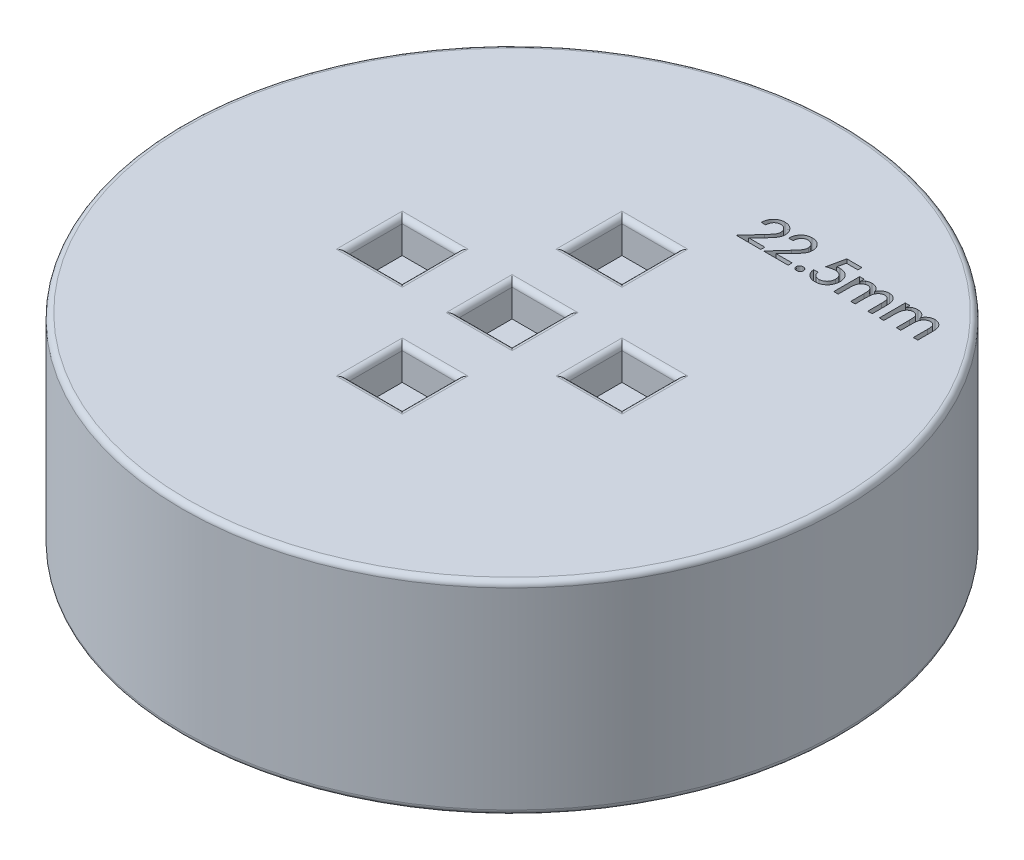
from build123d import *

# Parameters (mm, degrees)
SKETCH1_R           = 30
BOSS_EXTRUDE1_DEPTH = 18.5
SKETCH2_W           = 5
SKETCH2_H           = 5
CUT_EXTRUDE1_DEPTH  = 3
FILLET1_R           = 0.5
SKETCH4_W           = 5
SKETCH4_H           = 5
CUT_EXTRUDE2_DEPTH  = 3
FILLET2_R           = 0.5
FILLET3_R           = 0.5
CUT_EXTRUDE3_DEPTH  = 2


with BuildPart() as part:
    # Sketch1 → Boss-Extrude1 (new body)
    with BuildSketch(Plane(origin=(0, 0, 0), x_dir=(1, 0, 0), z_dir=(0, 1, 0))):
        with Locations(Location((0, 0, 0), (0, 0, 270))):
            Circle(SKETCH1_R)
    extrude(amount=BOSS_EXTRUDE1_DEPTH)

    # Sketch2 → Cut-Extrude1 (cut)
    with BuildSketch(Plane(origin=(0, 18.5, 0), x_dir=(1, 0, 0), z_dir=(0, 1, 0))):
        with Locations((0, -10)):
            Rectangle(SKETCH2_W, SKETCH2_H)
        with Locations((-10, 0)):
            Rectangle(SKETCH2_W, SKETCH2_H)
        Rectangle(SKETCH2_W, SKETCH2_H)
        with Locations((0, 10)):
            Rectangle(SKETCH2_W, SKETCH2_H)
        with Locations((10, 0)):
            Rectangle(SKETCH2_W, SKETCH2_H)
    extrude(amount=-CUT_EXTRUDE1_DEPTH, mode=Mode.SUBTRACT)

    # Fillet1
    fillet1_edges = [part.edges().sort_by_distance(p)[0] for p in [
        (2.5, 18.5, 0),
        (0, 18.5, 2.5),
        (-12.5, 18.5, 0),
        (-10, 18.5, 2.5),
        (-7.5, 18.5, 0),
        (-10, 18.5, -2.5),
    ]]
    fillet(fillet1_edges, radius=FILLET1_R)

    # Sketch4 → Cut-Extrude2 (cut)
    with BuildSketch(Plane(origin=(0, 0, 0), x_dir=(-1, 0, 0), z_dir=(0, -1, 0))):
        Rectangle(SKETCH4_W, SKETCH4_H)
        with Locations((0, -10)):
            Rectangle(SKETCH4_W, SKETCH4_H)
        with Locations((10, 0)):
            Rectangle(SKETCH4_W, SKETCH4_H)
        with Locations((-10, 0)):
            Rectangle(SKETCH4_W, SKETCH4_H)
        with Locations((0, 10)):
            Rectangle(SKETCH4_W, SKETCH4_H)
    extrude(amount=-CUT_EXTRUDE2_DEPTH, mode=Mode.SUBTRACT)

    # Fillet2
    fillet2_edges = [part.edges().sort_by_distance(p)[0] for p in [
        (-2.5, 0, 0),
        (0, 0, -2.5),
        (2.5, 0, 0),
        (0, 0, 2.5),
        (-2.5, 0, 10),
        (0, 0, 7.5),
        (2.5, 0, 10),
        (0, 0, 12.5),
        (-12.5, 0, 0),
        (-10, 0, -2.5),
        (-7.5, 0, 0),
        (-10, 0, 2.5),
        (7.5, 0, 0),
        (10, 0, -2.5),
        (12.5, 0, 0),
        (10, 0, 2.5),
        (2.5, 0, -10),
        (0, 0, -7.5),
        (-2.5, 0, -10),
        (0, 0, -12.5),
        (0, 0, -30),
    ]]
    fillet(fillet2_edges, radius=FILLET2_R)

    # Fillet3
    fillet3_edges = [part.edges().sort_by_distance(p)[0] for p in [
        (0, 18.5, -30),
        (0, 18.5, 7.5),
        (-2.5, 18.5, 10),
        (0, 18.5, 12.5),
        (2.5, 18.5, 10),
        (-2.5, 18.5, 0.25),
        (0.25, 18.5, -2.5),
        (0, 18.5, -12.5),
        (-2.5, 18.5, -10),
        (0, 18.5, -7.5),
        (2.5, 18.5, -10),
        (10, 18.5, 2.5),
        (12.5, 18.5, 0),
        (10, 18.5, -2.5),
        (7.5, 18.5, 0),
    ]]
    fillet(fillet3_edges, radius=FILLET3_R)

    # Sketch5 → Cut-Extrude3 (cut)
    with BuildSketch(Plane(origin=(0, 18.5, 0), x_dir=(1, 0, 0), z_dir=(0, 1, 0))):
        with BuildLine():
            Line((4.630208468, 18.456706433), (4.227609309, 18.456706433))
            add(Edge.make_bspline(
                [(4.227609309, 18.456706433), (4.229500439, 18.497673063), (4.233199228, 18.577798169), (4.249623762, 18.694549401), (4.276230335, 18.804558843), (4.309813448, 18.908759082), (4.354612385, 19.00584756), (4.406301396, 19.097516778), (4.468701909, 19.181845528), (4.539217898, 19.258967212), (4.615765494, 19.329035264), (4.698054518, 19.389453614), (4.784694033, 19.440938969), (4.875701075, 19.482951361), (4.971253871, 19.515480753), (5.071080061, 19.539151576), (5.175498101, 19.553389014), (5.246677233, 19.554952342), (5.282762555, 19.555744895)],
                knots=[0, 0, 0, 0, 1.154964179, 2.258951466, 3.315045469, 4.34063582, 5.337653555, 6.322213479, 7.300594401, 8.285733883, 9.262436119, 10.219305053, 11.156568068, 12.097250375, 13.037875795, 13.995471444, 14.983774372, 16, 16, 16, 16], degree=3))
            add(Edge.make_bspline(
                [(5.282762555, 19.555744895), (5.320543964, 19.554972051), (5.394681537, 19.553455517), (5.5026437, 19.539184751), (5.604820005, 19.51617315), (5.701240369, 19.484747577), (5.79172912, 19.442786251), (5.876464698, 19.39218552), (5.954632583, 19.331365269), (6.026800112, 19.263311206), (6.0905427, 19.188451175), (6.14811535, 19.111486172), (6.195704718, 19.030855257), (6.235572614, 18.948030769), (6.266251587, 18.862332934), (6.287916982, 18.774110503), (6.300903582, 18.683303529), (6.302676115, 18.6219008), (6.303570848, 18.590906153)],
                knots=[0, 0, 0, 0, 1.156722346, 2.269809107, 3.328396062, 4.361258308, 5.3694338, 6.377253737, 7.377324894, 8.397019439, 9.4098266, 10.385180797, 11.337325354, 12.27255833, 13.196816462, 14.119704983, 15.050871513, 16, 16, 16, 16], degree=3))
            add(Edge.make_bspline(
                [(6.303570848, 18.590906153), (6.301942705, 18.547549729), (6.298708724, 18.461430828), (6.273806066, 18.334022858), (6.231941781, 18.210718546), (6.183584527, 18.110316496), (6.134676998, 18.029160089), (6.089794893, 17.962172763), (6.037070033, 17.889739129), (5.975371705, 17.812344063), (5.907153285, 17.728216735), (5.829704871, 17.639527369), (5.745423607, 17.544480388), (5.685315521, 17.480480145), (5.654196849, 17.447346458)],
                knots=[0, 0, 0, 0, 1.155755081, 2.295677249, 3.447123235, 4.6205014, 5.259503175, 5.973005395, 6.77029923, 7.648035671, 8.612336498, 9.658570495, 10.787814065, 12, 12, 12, 12], degree=3))
            Line((5.654196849, 17.447346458), (4.873167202, 16.665680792))
            Line((4.873167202, 16.665680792), (6.344275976, 16.665680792))
            Line((6.344275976, 16.665680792), (6.344275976, 16.299334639))
            Line((6.344275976, 16.299334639), (4.105493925, 16.299334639))
            Line((4.105493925, 16.299334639), (5.320287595, 17.640695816))
            add(Edge.make_bspline(
                [(5.320287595, 17.640695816), (5.349222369, 17.67155443), (5.404748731, 17.730772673), (5.483005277, 17.817458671), (5.553610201, 17.897598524), (5.616939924, 17.971134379), (5.671336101, 18.039054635), (5.718262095, 18.100360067), (5.757186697, 18.155340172), (5.797610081, 18.220056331), (5.837665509, 18.297633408), (5.871739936, 18.392266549), (5.892186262, 18.488907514), (5.895074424, 18.553922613), (5.896519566, 18.58645403)],
                knots=[0, 0, 0, 0, 1.341560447, 2.574479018, 3.703506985, 4.728875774, 5.651874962, 6.462761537, 7.177175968, 7.787249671, 8.88179658, 9.938774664, 10.968630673, 12, 12, 12, 12], degree=3))
            add(Edge.make_bspline(
                [(5.896519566, 18.58645403), (5.896163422, 18.606635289), (5.89545872, 18.646567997), (5.885851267, 18.705044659), (5.872317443, 18.761763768), (5.851385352, 18.81581345), (5.826166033, 18.868257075), (5.794621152, 18.918416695), (5.756741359, 18.965827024), (5.714603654, 19.011554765), (5.667998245, 19.052841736), (5.618771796, 19.08987011), (5.566318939, 19.119941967), (5.512073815, 19.146240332), (5.454350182, 19.164884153), (5.394566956, 19.178765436), (5.332254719, 19.18838128), (5.289795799, 19.189055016), (5.268134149, 19.189398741)],
                knots=[0, 0, 0, 0, 0.999432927, 1.977580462, 2.931018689, 3.885672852, 4.844657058, 5.812871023, 6.815890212, 7.849665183, 8.891901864, 9.898878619, 10.897592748, 11.885014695, 12.882178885, 13.896915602, 14.927050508, 16, 16, 16, 16], degree=3))
            add(Edge.make_bspline(
                [(5.268134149, 19.189398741), (5.247540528, 19.188976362), (5.207027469, 19.188145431), (5.147361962, 19.179572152), (5.090090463, 19.165613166), (5.035019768, 19.146250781), (4.981751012, 19.122363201), (4.931586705, 19.091416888), (4.883706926, 19.055416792), (4.837478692, 19.015012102), (4.795405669, 18.967609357), (4.757774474, 18.91377029), (4.724544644, 18.853436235), (4.696141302, 18.786712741), (4.672602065, 18.713424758), (4.653718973, 18.6336614), (4.639120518, 18.547387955), (4.633234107, 18.487492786), (4.630208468, 18.456706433)],
                knots=[0, 0, 0, 0, 0.911540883, 1.79324023, 2.663162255, 3.518366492, 4.375475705, 5.243419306, 6.122264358, 7.02676621, 7.957780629, 8.921596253, 9.930241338, 11.002848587, 12.128200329, 13.335197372, 14.630280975, 16, 16, 16, 16], degree=3))
        make_face()
        with BuildLine():
            Line((7.113221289, 18.456706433), (6.71062213, 18.456706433))
            add(Edge.make_bspline(
                [(6.71062213, 18.456706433), (6.712513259, 18.497673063), (6.716212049, 18.577798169), (6.732636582, 18.694549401), (6.759243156, 18.804558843), (6.792826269, 18.908759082), (6.837625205, 19.00584756), (6.889314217, 19.097516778), (6.95171473, 19.181845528), (7.022230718, 19.258967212), (7.098778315, 19.329035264), (7.181067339, 19.389453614), (7.267706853, 19.440938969), (7.358713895, 19.482951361), (7.454266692, 19.515480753), (7.554092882, 19.539151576), (7.658510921, 19.553389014), (7.729690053, 19.554952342), (7.765775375, 19.555744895)],
                knots=[0, 0, 0, 0, 1.154964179, 2.258951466, 3.315045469, 4.34063582, 5.337653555, 6.322213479, 7.300594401, 8.285733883, 9.262436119, 10.219305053, 11.156568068, 12.097250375, 13.037875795, 13.995471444, 14.983774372, 16, 16, 16, 16], degree=3))
            add(Edge.make_bspline(
                [(7.765775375, 19.555744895), (7.803556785, 19.554972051), (7.877694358, 19.553455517), (7.985656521, 19.539184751), (8.087832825, 19.51617315), (8.184253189, 19.484747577), (8.274741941, 19.442786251), (8.359477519, 19.39218552), (8.437645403, 19.331365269), (8.509812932, 19.263311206), (8.573555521, 19.188451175), (8.63112817, 19.111486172), (8.678717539, 19.030855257), (8.718585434, 18.948030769), (8.749264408, 18.862332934), (8.770929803, 18.774110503), (8.783916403, 18.683303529), (8.785688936, 18.6219008), (8.786583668, 18.590906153)],
                knots=[0, 0, 0, 0, 1.156722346, 2.269809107, 3.328396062, 4.361258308, 5.3694338, 6.377253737, 7.377324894, 8.397019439, 9.4098266, 10.385180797, 11.337325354, 12.27255833, 13.196816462, 14.119704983, 15.050871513, 16, 16, 16, 16], degree=3))
            add(Edge.make_bspline(
                [(8.786583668, 18.590906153), (8.784955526, 18.547549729), (8.781721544, 18.461430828), (8.756818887, 18.334022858), (8.714954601, 18.210718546), (8.666597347, 18.110316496), (8.617689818, 18.029160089), (8.572807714, 17.962172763), (8.520082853, 17.889739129), (8.458384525, 17.812344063), (8.390166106, 17.728216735), (8.312717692, 17.639527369), (8.228436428, 17.544480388), (8.168328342, 17.480480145), (8.13720967, 17.447346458)],
                knots=[0, 0, 0, 0, 1.155755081, 2.295677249, 3.447123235, 4.6205014, 5.259503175, 5.973005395, 6.77029923, 7.648035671, 8.612336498, 9.658570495, 10.787814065, 12, 12, 12, 12], degree=3))
            Line((8.13720967, 17.447346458), (7.356180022, 16.665680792))
            Line((7.356180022, 16.665680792), (8.827288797, 16.665680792))
            Line((8.827288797, 16.665680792), (8.827288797, 16.299334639))
            Line((8.827288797, 16.299334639), (6.588506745, 16.299334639))
            Line((6.588506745, 16.299334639), (7.803300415, 17.640695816))
            add(Edge.make_bspline(
                [(7.803300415, 17.640695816), (7.83223519, 17.67155443), (7.887761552, 17.730772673), (7.966018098, 17.817458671), (8.036623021, 17.897598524), (8.099952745, 17.971134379), (8.154348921, 18.039054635), (8.201274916, 18.100360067), (8.240199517, 18.155340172), (8.280622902, 18.220056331), (8.320678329, 18.297633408), (8.354752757, 18.392266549), (8.375199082, 18.488907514), (8.378087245, 18.553922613), (8.379532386, 18.58645403)],
                knots=[0, 0, 0, 0, 1.341560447, 2.574479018, 3.703506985, 4.728875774, 5.651874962, 6.462761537, 7.177175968, 7.787249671, 8.88179658, 9.938774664, 10.968630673, 12, 12, 12, 12], degree=3))
            add(Edge.make_bspline(
                [(8.379532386, 18.58645403), (8.379176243, 18.606635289), (8.378471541, 18.646567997), (8.368864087, 18.705044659), (8.355330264, 18.761763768), (8.334398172, 18.81581345), (8.309178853, 18.868257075), (8.277633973, 18.918416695), (8.23975418, 18.965827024), (8.197616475, 19.011554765), (8.151011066, 19.052841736), (8.101784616, 19.08987011), (8.049331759, 19.119941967), (7.995086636, 19.146240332), (7.937363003, 19.164884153), (7.877579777, 19.178765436), (7.815267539, 19.18838128), (7.772808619, 19.189055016), (7.75114697, 19.189398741)],
                knots=[0, 0, 0, 0, 0.999432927, 1.977580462, 2.931018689, 3.885672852, 4.844657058, 5.812871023, 6.815890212, 7.849665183, 8.891901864, 9.898878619, 10.897592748, 11.885014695, 12.882178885, 13.896915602, 14.927050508, 16, 16, 16, 16], degree=3))
            add(Edge.make_bspline(
                [(7.75114697, 19.189398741), (7.730553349, 19.188976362), (7.69004029, 19.188145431), (7.630374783, 19.179572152), (7.573103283, 19.165613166), (7.518032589, 19.146250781), (7.464763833, 19.122363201), (7.414599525, 19.091416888), (7.366719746, 19.055416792), (7.320491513, 19.015012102), (7.278418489, 18.967609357), (7.240787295, 18.91377029), (7.207557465, 18.853436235), (7.179154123, 18.786712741), (7.155614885, 18.713424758), (7.136731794, 18.6336614), (7.122133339, 18.547387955), (7.116246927, 18.487492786), (7.113221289, 18.456706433)],
                knots=[0, 0, 0, 0, 0.911540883, 1.79324023, 2.663162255, 3.518366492, 4.375475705, 5.243419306, 6.122264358, 7.02676621, 7.957780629, 8.921596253, 9.930241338, 11.002848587, 12.128200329, 13.335197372, 14.630280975, 16, 16, 16, 16], degree=3))
        make_face()
        with BuildLine():
            add(Edge.make_bspline(
                [(9.621038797, 16.869206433), (9.645751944, 16.868260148), (9.69334192, 16.866437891), (9.760917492, 16.848142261), (9.821098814, 16.817751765), (9.871537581, 16.775525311), (9.91382962, 16.727897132), (9.943859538, 16.675626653), (9.964193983, 16.620926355), (9.966084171, 16.582962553), (9.967032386, 16.563917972)],
                knots=[0, 0, 0, 0, 1.15701891, 2.228065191, 3.255424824, 4.294461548, 5.295444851, 6.226722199, 7.110433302, 8, 8, 8, 8], degree=3))
            add(Edge.make_bspline(
                [(9.967032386, 16.563917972), (9.965998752, 16.545111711), (9.963930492, 16.507481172), (9.944707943, 16.452691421), (9.914212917, 16.400539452), (9.872402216, 16.352370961), (9.821882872, 16.309938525), (9.761095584, 16.280528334), (9.693666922, 16.261215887), (9.645773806, 16.259510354), (9.621038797, 16.25862951)],
                knots=[0, 0, 0, 0, 0.879435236, 1.759712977, 2.690738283, 3.698978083, 4.737733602, 5.760330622, 6.843294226, 8, 8, 8, 8], degree=3))
            add(Edge.make_bspline(
                [(9.621038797, 16.25862951), (9.60057684, 16.259738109), (9.560438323, 16.261912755), (9.502616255, 16.278873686), (9.450157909, 16.307784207), (9.403421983, 16.346286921), (9.364684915, 16.393137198), (9.336300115, 16.445839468), (9.318919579, 16.503485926), (9.316824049, 16.543444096), (9.315750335, 16.563917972)],
                knots=[0, 0, 0, 0, 1.022542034, 2.005835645, 2.98339371, 4.000421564, 5.017449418, 6.004339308, 6.977457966, 8, 8, 8, 8], degree=3))
            add(Edge.make_bspline(
                [(9.315750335, 16.563917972), (9.316838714, 16.584596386), (9.318963, 16.624956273), (9.336026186, 16.682951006), (9.364708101, 16.735387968), (9.403642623, 16.781550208), (9.450229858, 16.820295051), (9.502967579, 16.848650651), (9.560604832, 16.86603877), (9.600564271, 16.868133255), (9.621038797, 16.869206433)],
                knots=[0, 0, 0, 0, 1.03279153, 2.015790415, 2.993055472, 4.001620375, 5.018343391, 6.004937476, 6.977764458, 8, 8, 8, 8], degree=3))
        make_face()
        with BuildLine():
            Line((12.36863495, 19.474334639), (12.36863495, 19.107988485))
            Line((12.36863495, 19.107988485), (11.32556604, 19.107988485))
            Line((11.32556604, 19.107988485), (11.155113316, 18.355579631))
            add(Edge.make_bspline(
                [(11.155113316, 18.355579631), (11.174998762, 18.365163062), (11.215923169, 18.384885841), (11.28434256, 18.40207039), (11.358626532, 18.414161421), (11.410522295, 18.415371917), (11.437505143, 18.416001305)],
                knots=[0, 0, 0, 0, 0.906577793, 1.865744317, 2.890308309, 4, 4, 4, 4], degree=3))
            add(Edge.make_bspline(
                [(11.437505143, 18.416001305), (11.475721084, 18.415301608), (11.550751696, 18.41392787), (11.660102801, 18.398576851), (11.764304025, 18.375578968), (11.862498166, 18.341270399), (11.955806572, 18.299034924), (12.043216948, 18.246183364), (12.12463851, 18.183612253), (12.199962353, 18.112387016), (12.268613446, 18.034805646), (12.327575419, 17.951025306), (12.378685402, 17.863493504), (12.419197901, 17.770697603), (12.451206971, 17.67359748), (12.473971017, 17.571787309), (12.488442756, 17.465572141), (12.48997412, 17.393120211), (12.490750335, 17.356395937)],
                knots=[0, 0, 0, 0, 1.094894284, 2.149641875, 3.159658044, 4.149576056, 5.125966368, 6.091225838, 7.071072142, 8.064343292, 9.05924964, 10.03573454, 10.996966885, 11.96032995, 12.932910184, 13.923798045, 14.947619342, 16, 16, 16, 16], degree=3))
            add(Edge.make_bspline(
                [(12.490750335, 17.356395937), (12.490153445, 17.330733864), (12.488972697, 17.279969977), (12.482819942, 17.204487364), (12.471075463, 17.13063295), (12.455481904, 17.057836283), (12.433995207, 16.986721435), (12.409535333, 16.916342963), (12.379484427, 16.847822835), (12.345176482, 16.781189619), (12.307112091, 16.716930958), (12.265201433, 16.655826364), (12.21934875, 16.59836436), (12.169391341, 16.545025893), (12.116694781, 16.494439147), (12.05988444, 16.447924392), (11.999121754, 16.405286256), (11.93527345, 16.366058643), (11.868370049, 16.330619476), (11.798018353, 16.301276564), (11.725964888, 16.274615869), (11.650427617, 16.254653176), (11.572830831, 16.237855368), (11.492243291, 16.226707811), (11.409229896, 16.21943986), (11.352930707, 16.218435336), (11.324294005, 16.217924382)],
                knots=[0, 0, 0, 0, 1.012275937, 2.002451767, 2.98397589, 3.959820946, 4.936095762, 5.911940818, 6.896771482, 7.884012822, 8.866284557, 9.840372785, 10.804070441, 11.762530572, 12.720625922, 13.68308951, 14.655094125, 15.646011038, 16.637104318, 17.63729087, 18.650257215, 19.66446511, 20.715636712, 21.77986274, 22.870722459, 24, 24, 24, 24], degree=3))
            add(Edge.make_bspline(
                [(11.324294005, 16.217924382), (11.292040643, 16.218698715), (11.22841143, 16.220226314), (11.13495888, 16.231061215), (11.045306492, 16.249444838), (10.959834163, 16.275760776), (10.877905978, 16.308768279), (10.800220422, 16.349600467), (10.72647561, 16.397890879), (10.656576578, 16.452718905), (10.592825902, 16.515263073), (10.534061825, 16.582593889), (10.483994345, 16.657190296), (10.439950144, 16.736993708), (10.402106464, 16.822653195), (10.371999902, 16.914331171), (10.347926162, 17.011680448), (10.338304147, 17.07898389), (10.33337854, 17.113437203)],
                knots=[0, 0, 0, 0, 1.049569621, 2.070583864, 3.057046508, 4.023914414, 4.977170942, 5.927726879, 6.875021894, 7.842677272, 8.813672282, 9.777581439, 10.74592533, 11.731059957, 12.74126976, 13.788569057, 14.867946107, 16, 16, 16, 16], degree=3))
            Line((10.33337854, 17.113437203), (10.730889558, 17.113437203))
            add(Edge.make_bspline(
                [(10.730889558, 17.113437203), (10.738455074, 17.080163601), (10.75265732, 17.017701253), (10.783167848, 16.932592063), (10.815868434, 16.860206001), (10.855864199, 16.801006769), (10.901769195, 16.752413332), (10.952720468, 16.710232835), (11.008696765, 16.672395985), (11.070320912, 16.640988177), (11.135248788, 16.615542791), (11.202711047, 16.597783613), (11.271345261, 16.586616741), (11.317680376, 16.585052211), (11.340830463, 16.584270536)],
                knots=[0, 0, 0, 0, 1.385459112, 2.600831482, 3.66841355, 4.605180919, 5.48910649, 6.376050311, 7.288896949, 8.229144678, 9.181161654, 10.117453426, 11.059436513, 12, 12, 12, 12], degree=3))
            add(Edge.make_bspline(
                [(11.340830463, 16.584270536), (11.365873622, 16.585111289), (11.415316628, 16.586771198), (11.488154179, 16.596708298), (11.557813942, 16.615089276), (11.625301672, 16.638914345), (11.689438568, 16.67136508), (11.751798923, 16.709255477), (11.810108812, 16.755783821), (11.865997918, 16.807517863), (11.917186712, 16.864821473), (11.961759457, 16.92673549), (11.99978195, 16.992016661), (12.030082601, 17.061099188), (12.054674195, 17.133350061), (12.071577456, 17.209262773), (12.082123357, 17.288678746), (12.083166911, 17.342793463), (12.083699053, 17.370388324)],
                knots=[0, 0, 0, 0, 0.99750234, 1.969380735, 2.919490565, 3.862219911, 4.813679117, 5.776605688, 6.762898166, 7.778387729, 8.806918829, 9.816812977, 10.811632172, 11.809420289, 12.815921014, 13.846113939, 14.901663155, 16, 16, 16, 16], degree=3))
            add(Edge.make_bspline(
                [(12.083699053, 17.370388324), (12.083066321, 17.395009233), (12.081823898, 17.443354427), (12.072722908, 17.514012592), (12.058286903, 17.58141175), (12.037310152, 17.644918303), (12.010345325, 17.704883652), (11.977186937, 17.76092419), (11.937936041, 17.81335199), (11.893794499, 17.862336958), (11.843825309, 17.906105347), (11.790173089, 17.945277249), (11.731208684, 17.976958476), (11.669058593, 18.004069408), (11.602285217, 18.023883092), (11.532084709, 18.039848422), (11.457178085, 18.0475189), (11.405928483, 18.048930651), (11.379627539, 18.049655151)],
                knots=[0, 0, 0, 0, 1.071512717, 2.104004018, 3.095982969, 4.067795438, 5.009520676, 5.952827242, 6.895998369, 7.856350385, 8.817411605, 9.782937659, 10.74115891, 11.725120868, 12.729302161, 13.768330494, 14.854722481, 16, 16, 16, 16], degree=3))
            add(Edge.make_bspline(
                [(11.379627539, 18.049655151), (11.357136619, 18.0491154), (11.309919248, 18.047982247), (11.23603246, 18.039788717), (11.15562898, 18.026901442), (11.068835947, 18.009077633), (10.975569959, 17.985856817), (10.875717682, 17.957718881), (10.76916863, 17.92488524), (10.696472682, 17.899772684), (10.659019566, 17.886834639)],
                knots=[0, 0, 0, 0, 0.727614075, 1.527550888, 2.402655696, 3.361819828, 4.39328773, 5.511706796, 6.718025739, 8, 8, 8, 8], degree=3))
            Line((10.659019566, 17.886834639), (10.992292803, 19.474334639))
            Line((10.992292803, 19.474334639), (12.36863495, 19.474334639))
        make_face()
        with BuildLine():
            Line((12.979211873, 18.660232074), (13.386263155, 18.660232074))
            Line((13.386263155, 18.660232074), (13.386263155, 18.263993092))
            add(Edge.make_bspline(
                [(13.386263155, 18.263993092), (13.390172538, 18.281043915), (13.397800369, 18.314312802), (13.414597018, 18.361788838), (13.43511691, 18.405690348), (13.458471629, 18.447066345), (13.486851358, 18.48431191), (13.517894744, 18.519312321), (13.55383483, 18.549721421), (13.579872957, 18.567390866), (13.592968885, 18.576277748)],
                knots=[0, 0, 0, 0, 1.08898891, 2.124791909, 3.129224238, 4.105481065, 5.077441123, 6.040388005, 7.014409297, 8, 8, 8, 8], degree=3))
            add(Edge.make_bspline(
                [(13.592968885, 18.576277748), (13.632387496, 18.595587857), (13.710218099, 18.633714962), (13.833315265, 18.671588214), (13.95785462, 18.696821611), (14.041873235, 18.699563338), (14.083974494, 18.700937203)],
                knots=[0, 0, 0, 0, 1.028471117, 2.030678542, 3.013184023, 4, 4, 4, 4], degree=3))
            add(Edge.make_bspline(
                [(14.083974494, 18.700937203), (14.114981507, 18.700147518), (14.176470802, 18.698581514), (14.267517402, 18.683981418), (14.355942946, 18.660512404), (14.440913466, 18.628121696), (14.520182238, 18.588378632), (14.59255643, 18.543470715), (14.656263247, 18.49256108), (14.712121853, 18.436819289), (14.758536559, 18.37432492), (14.795137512, 18.305893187), (14.821103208, 18.230671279), (14.829939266, 18.17788171), (14.834475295, 18.150781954)],
                knots=[0, 0, 0, 0, 1.099015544, 2.179432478, 3.260947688, 4.338981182, 5.398181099, 6.40160478, 7.353922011, 8.284349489, 9.192639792, 10.104191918, 11.026778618, 12, 12, 12, 12], degree=3))
            add(Edge.make_bspline(
                [(14.834475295, 18.150781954), (14.841822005, 18.171666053), (14.856349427, 18.212962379), (14.882914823, 18.272456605), (14.91509506, 18.327987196), (14.951486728, 18.380296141), (14.992098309, 18.429705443), (15.038378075, 18.474495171), (15.08795476, 18.517164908), (15.142626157, 18.554568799), (15.199494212, 18.588880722), (15.258172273, 18.618793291), (15.317776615, 18.644429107), (15.378787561, 18.664573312), (15.440421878, 18.681527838), (15.503632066, 18.692931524), (15.56789051, 18.699140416), (15.61104048, 18.700337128), (15.632677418, 18.700937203)],
                knots=[0, 0, 0, 0, 1.024672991, 2.026193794, 3.01103273, 3.991165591, 4.973850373, 5.96628909, 6.969107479, 7.9982829, 9.028393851, 10.042340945, 11.044967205, 12.028827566, 13.014448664, 14.002022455, 14.998142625, 16, 16, 16, 16], degree=3))
            add(Edge.make_bspline(
                [(15.632677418, 18.700937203), (15.654744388, 18.700648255), (15.698126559, 18.700080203), (15.762044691, 18.6932808), (15.8239544, 18.683370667), (15.883761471, 18.668812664), (15.941249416, 18.649476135), (15.996694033, 18.626505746), (16.050368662, 18.600037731), (16.117475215, 18.558287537), (16.195703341, 18.500029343), (16.27507809, 18.415918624), (16.341602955, 18.322199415), (16.384825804, 18.234869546), (16.412364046, 18.158232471), (16.430867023, 18.093903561), (16.4457372, 18.023052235), (16.458607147, 17.946061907), (16.467834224, 17.862383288), (16.474663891, 17.772440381), (16.479373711, 17.675938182), (16.479689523, 17.609536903), (16.479852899, 17.575186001)],
                knots=[0, 0, 0, 0, 0.823429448, 1.618806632, 2.396867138, 3.162757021, 3.913573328, 4.658737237, 5.40200746, 6.144476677, 7.607081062, 9.028926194, 10.443018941, 11.88355177, 12.649646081, 13.481287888, 14.380074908, 15.350698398, 16.394246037, 17.521443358, 18.717785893, 20, 20, 20, 20], degree=3))
            Line((16.479852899, 17.575186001), (16.479852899, 16.299334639))
            Line((16.479852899, 16.299334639), (16.072801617, 16.299334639))
            Line((16.072801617, 16.299334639), (16.072801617, 17.573913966))
            add(Edge.make_bspline(
                [(16.072801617, 17.573913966), (16.072750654, 17.602325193), (16.072652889, 17.656828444), (16.069966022, 17.734861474), (16.066191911, 17.805687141), (16.061432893, 17.869371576), (16.054400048, 17.926007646), (16.046192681, 17.975664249), (16.037240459, 18.018386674), (16.021818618, 18.065090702), (15.997723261, 18.116141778), (15.960082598, 18.170665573), (15.913816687, 18.218659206), (15.859518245, 18.259894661), (15.798585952, 18.294105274), (15.730633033, 18.317178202), (15.657542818, 18.33262228), (15.606685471, 18.333922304), (15.580523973, 18.334591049)],
                knots=[0, 0, 0, 0, 1.305376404, 2.504195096, 3.587062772, 4.564309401, 5.437885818, 6.208191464, 6.877018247, 7.440755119, 8.464755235, 9.459136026, 10.471907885, 11.51427718, 12.582498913, 13.666986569, 14.799875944, 16, 16, 16, 16], degree=3))
            add(Edge.make_bspline(
                [(15.580523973, 18.334591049), (15.551374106, 18.333169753), (15.493005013, 18.330323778), (15.406801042, 18.309490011), (15.324044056, 18.273474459), (15.244608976, 18.225457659), (15.17168311, 18.164392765), (15.107089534, 18.091809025), (15.053797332, 18.006947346), (15.016163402, 17.928072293), (14.991867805, 17.855952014), (14.976527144, 17.792012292), (14.962214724, 17.719529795), (14.952182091, 17.637863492), (14.942775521, 17.547369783), (14.937840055, 17.447808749), (14.933621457, 17.33925947), (14.93325102, 17.263966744), (14.933058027, 17.224740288)],
                knots=[0, 0, 0, 0, 0.96585306, 1.934004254, 2.919496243, 3.947541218, 5.000269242, 6.060662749, 7.154254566, 8.311133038, 8.948925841, 9.673294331, 10.489200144, 11.396606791, 12.399336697, 13.504450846, 14.699853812, 16, 16, 16, 16], degree=3))
            Line((14.933058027, 17.224740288), (14.933058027, 16.299334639))
            Line((14.933058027, 16.299334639), (14.526006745, 16.299334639))
            Line((14.526006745, 16.299334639), (14.526006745, 17.496955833))
            add(Edge.make_bspline(
                [(14.526006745, 17.496955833), (14.525957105, 17.528970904), (14.525862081, 17.590256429), (14.523168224, 17.67804002), (14.519380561, 17.757767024), (14.51468963, 17.829291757), (14.507655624, 17.892502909), (14.499373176, 17.947440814), (14.490553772, 17.994411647), (14.47516041, 18.045024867), (14.451627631, 18.100490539), (14.413845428, 18.159258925), (14.367280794, 18.211088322), (14.312333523, 18.254808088), (14.250752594, 18.290614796), (14.182883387, 18.316244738), (14.109491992, 18.331900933), (14.058613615, 18.333677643), (14.032457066, 18.334591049)],
                knots=[0, 0, 0, 0, 1.376972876, 2.63589934, 3.777064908, 4.810071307, 5.718390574, 6.511518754, 7.200035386, 7.771255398, 8.78422519, 9.780850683, 10.762300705, 11.767731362, 12.789080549, 13.813681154, 14.876014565, 16, 16, 16, 16], degree=3))
            add(Edge.make_bspline(
                [(14.032457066, 18.334591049), (14.004580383, 18.333120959), (13.948570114, 18.330167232), (13.865483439, 18.309843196), (13.784457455, 18.275058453), (13.705647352, 18.228482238), (13.631684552, 18.169649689), (13.566670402, 18.097771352), (13.511298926, 18.014290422), (13.473010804, 17.935882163), (13.447837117, 17.86548222), (13.431755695, 17.804745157), (13.416832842, 17.737371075), (13.405846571, 17.662735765), (13.396961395, 17.581267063), (13.390772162, 17.492794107), (13.38692521, 17.397347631), (13.386488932, 17.331383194), (13.386263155, 17.297246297)],
                knots=[0, 0, 0, 0, 0.973948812, 1.956873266, 2.969584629, 4.045778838, 5.147278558, 6.259119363, 7.418022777, 8.637370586, 9.298195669, 10.027900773, 10.831491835, 11.708502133, 12.662464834, 13.694928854, 14.807115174, 16, 16, 16, 16], degree=3))
            Line((13.386263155, 17.297246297), (13.386263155, 16.299334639))
            Line((13.386263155, 16.299334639), (12.979211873, 16.299334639))
            Line((12.979211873, 16.299334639), (12.979211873, 18.660232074))
        make_face()
        with BuildLine():
            Line((17.13113495, 18.660232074), (17.538186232, 18.660232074))
            Line((17.538186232, 18.660232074), (17.538186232, 18.263993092))
            add(Edge.make_bspline(
                [(17.538186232, 18.263993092), (17.542095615, 18.281043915), (17.549723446, 18.314312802), (17.566520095, 18.361788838), (17.587039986, 18.405690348), (17.610394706, 18.447066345), (17.638774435, 18.48431191), (17.669817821, 18.519312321), (17.705757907, 18.549721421), (17.731796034, 18.567390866), (17.744891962, 18.576277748)],
                knots=[0, 0, 0, 0, 1.08898891, 2.124791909, 3.129224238, 4.105481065, 5.077441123, 6.040388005, 7.014409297, 8, 8, 8, 8], degree=3))
            add(Edge.make_bspline(
                [(17.744891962, 18.576277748), (17.784310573, 18.595587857), (17.862141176, 18.633714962), (17.985238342, 18.671588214), (18.109777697, 18.696821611), (18.193796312, 18.699563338), (18.235897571, 18.700937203)],
                knots=[0, 0, 0, 0, 1.028471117, 2.030678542, 3.013184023, 4, 4, 4, 4], degree=3))
            add(Edge.make_bspline(
                [(18.235897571, 18.700937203), (18.266904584, 18.700147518), (18.328393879, 18.698581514), (18.419440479, 18.683981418), (18.507866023, 18.660512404), (18.592836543, 18.628121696), (18.672105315, 18.588378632), (18.744479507, 18.543470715), (18.808186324, 18.49256108), (18.86404493, 18.436819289), (18.910459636, 18.37432492), (18.947060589, 18.305893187), (18.973026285, 18.230671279), (18.981862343, 18.17788171), (18.986398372, 18.150781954)],
                knots=[0, 0, 0, 0, 1.099015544, 2.179432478, 3.260947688, 4.338981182, 5.398181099, 6.40160478, 7.353922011, 8.284349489, 9.192639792, 10.104191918, 11.026778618, 12, 12, 12, 12], degree=3))
            add(Edge.make_bspline(
                [(18.986398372, 18.150781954), (18.993745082, 18.171666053), (19.008272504, 18.212962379), (19.0348379, 18.272456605), (19.067018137, 18.327987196), (19.103409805, 18.380296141), (19.144021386, 18.429705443), (19.190301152, 18.474495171), (19.239877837, 18.517164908), (19.294549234, 18.554568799), (19.351417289, 18.588880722), (19.41009535, 18.618793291), (19.469699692, 18.644429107), (19.530710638, 18.664573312), (19.592344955, 18.681527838), (19.655555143, 18.692931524), (19.719813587, 18.699140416), (19.762963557, 18.700337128), (19.784600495, 18.700937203)],
                knots=[0, 0, 0, 0, 1.024672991, 2.026193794, 3.01103273, 3.991165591, 4.973850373, 5.96628909, 6.969107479, 7.9982829, 9.028393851, 10.042340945, 11.044967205, 12.028827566, 13.014448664, 14.002022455, 14.998142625, 16, 16, 16, 16], degree=3))
            add(Edge.make_bspline(
                [(19.784600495, 18.700937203), (19.806667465, 18.700648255), (19.850049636, 18.700080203), (19.913967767, 18.6932808), (19.975877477, 18.683370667), (20.035684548, 18.668812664), (20.093172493, 18.649476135), (20.14861711, 18.626505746), (20.202291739, 18.600037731), (20.269398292, 18.558287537), (20.347626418, 18.500029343), (20.427001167, 18.415918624), (20.493526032, 18.322199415), (20.536748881, 18.234869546), (20.564287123, 18.158232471), (20.5827901, 18.093903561), (20.597660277, 18.023052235), (20.610530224, 17.946061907), (20.619757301, 17.862383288), (20.626586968, 17.772440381), (20.631296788, 17.675938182), (20.631612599, 17.609536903), (20.631775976, 17.575186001)],
                knots=[0, 0, 0, 0, 0.823429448, 1.618806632, 2.396867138, 3.162757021, 3.913573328, 4.658737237, 5.40200746, 6.144476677, 7.607081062, 9.028926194, 10.443018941, 11.88355177, 12.649646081, 13.481287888, 14.380074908, 15.350698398, 16.394246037, 17.521443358, 18.717785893, 20, 20, 20, 20], degree=3))
            Line((20.631775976, 17.575186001), (20.631775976, 16.299334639))
            Line((20.631775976, 16.299334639), (20.224724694, 16.299334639))
            Line((20.224724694, 16.299334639), (20.224724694, 17.573913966))
            add(Edge.make_bspline(
                [(20.224724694, 17.573913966), (20.224673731, 17.602325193), (20.224575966, 17.656828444), (20.221889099, 17.734861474), (20.218114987, 17.805687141), (20.21335597, 17.869371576), (20.206323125, 17.926007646), (20.198115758, 17.975664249), (20.189163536, 18.018386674), (20.173741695, 18.065090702), (20.149646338, 18.116141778), (20.112005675, 18.170665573), (20.065739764, 18.218659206), (20.011441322, 18.259894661), (19.950509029, 18.294105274), (19.88255611, 18.317178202), (19.809465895, 18.33262228), (19.758608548, 18.333922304), (19.73244705, 18.334591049)],
                knots=[0, 0, 0, 0, 1.305376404, 2.504195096, 3.587062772, 4.564309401, 5.437885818, 6.208191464, 6.877018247, 7.440755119, 8.464755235, 9.459136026, 10.471907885, 11.51427718, 12.582498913, 13.666986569, 14.799875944, 16, 16, 16, 16], degree=3))
            add(Edge.make_bspline(
                [(19.73244705, 18.334591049), (19.703297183, 18.333169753), (19.64492809, 18.330323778), (19.558724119, 18.309490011), (19.475967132, 18.273474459), (19.396532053, 18.225457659), (19.323606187, 18.164392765), (19.259012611, 18.091809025), (19.205720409, 18.006947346), (19.168086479, 17.928072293), (19.143790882, 17.855952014), (19.128450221, 17.792012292), (19.1141378, 17.719529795), (19.104105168, 17.637863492), (19.094698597, 17.547369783), (19.089763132, 17.447808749), (19.085544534, 17.33925947), (19.085174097, 17.263966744), (19.084981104, 17.224740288)],
                knots=[0, 0, 0, 0, 0.96585306, 1.934004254, 2.919496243, 3.947541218, 5.000269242, 6.060662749, 7.154254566, 8.311133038, 8.948925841, 9.673294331, 10.489200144, 11.396606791, 12.399336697, 13.504450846, 14.699853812, 16, 16, 16, 16], degree=3))
            Line((19.084981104, 17.224740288), (19.084981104, 16.299334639))
            Line((19.084981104, 16.299334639), (18.677929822, 16.299334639))
            Line((18.677929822, 16.299334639), (18.677929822, 17.496955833))
            add(Edge.make_bspline(
                [(18.677929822, 17.496955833), (18.677880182, 17.528970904), (18.677785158, 17.590256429), (18.6750913, 17.67804002), (18.671303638, 17.757767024), (18.666612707, 17.829291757), (18.659578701, 17.892502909), (18.651296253, 17.947440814), (18.642476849, 17.994411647), (18.627083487, 18.045024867), (18.603550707, 18.100490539), (18.565768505, 18.159258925), (18.519203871, 18.211088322), (18.464256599, 18.254808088), (18.402675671, 18.290614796), (18.334806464, 18.316244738), (18.261415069, 18.331900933), (18.210536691, 18.333677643), (18.184380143, 18.334591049)],
                knots=[0, 0, 0, 0, 1.376972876, 2.63589934, 3.777064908, 4.810071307, 5.718390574, 6.511518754, 7.200035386, 7.771255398, 8.78422519, 9.780850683, 10.762300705, 11.767731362, 12.789080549, 13.813681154, 14.876014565, 16, 16, 16, 16], degree=3))
            add(Edge.make_bspline(
                [(18.184380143, 18.334591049), (18.15650346, 18.333120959), (18.100493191, 18.330167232), (18.017406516, 18.309843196), (17.936380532, 18.275058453), (17.857570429, 18.228482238), (17.783607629, 18.169649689), (17.718593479, 18.097771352), (17.663222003, 18.014290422), (17.624933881, 17.935882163), (17.599760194, 17.86548222), (17.583678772, 17.804745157), (17.568755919, 17.737371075), (17.557769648, 17.662735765), (17.548884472, 17.581267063), (17.542695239, 17.492794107), (17.538848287, 17.397347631), (17.538412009, 17.331383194), (17.538186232, 17.297246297)],
                knots=[0, 0, 0, 0, 0.973948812, 1.956873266, 2.969584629, 4.045778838, 5.147278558, 6.259119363, 7.418022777, 8.637370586, 9.298195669, 10.027900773, 10.831491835, 11.708502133, 12.662464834, 13.694928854, 14.807115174, 16, 16, 16, 16], degree=3))
            Line((17.538186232, 17.297246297), (17.538186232, 16.299334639))
            Line((17.538186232, 16.299334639), (17.13113495, 16.299334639))
            Line((17.13113495, 16.299334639), (17.13113495, 18.660232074))
        make_face()
    extrude(amount=-CUT_EXTRUDE3_DEPTH, mode=Mode.SUBTRACT)


solid = part.part
